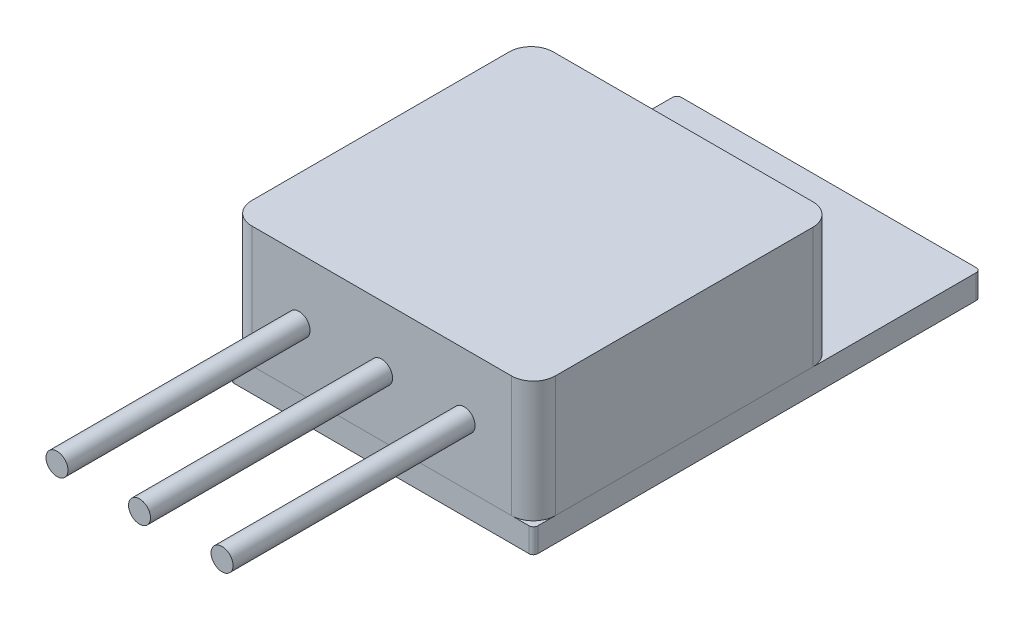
ISO-10303-21;
HEADER;
FILE_DESCRIPTION(('STEP AP214'),'2;1');
FILE_NAME('part.step','',(''),(''),'','','');
FILE_SCHEMA(('AUTOMOTIVE_DESIGN { 1 0 10303 214 1 1 1 1 }'));
ENDSEC;
DATA;
#1=APPLICATION_CONTEXT('core data for automotive mechanical design processes');
#2=APPLICATION_PROTOCOL_DEFINITION('international standard','automotive_design',2000,#1);
#3=PRODUCT_CONTEXT('',#1,'mechanical');
#4=PRODUCT('Part','Part','',(#3));
#5=PRODUCT_RELATED_PRODUCT_CATEGORY('part','',(#4));
#6=PRODUCT_DEFINITION_FORMATION('','',#4);
#7=PRODUCT_DEFINITION_CONTEXT('part definition',#1,'design');
#8=PRODUCT_DEFINITION('design','',#6,#7);
#9=PRODUCT_DEFINITION_SHAPE('','',#8);
#10=(LENGTH_UNIT() NAMED_UNIT(*) SI_UNIT(.MILLI.,.METRE.));
#11=(NAMED_UNIT(*) PLANE_ANGLE_UNIT() SI_UNIT($,.RADIAN.));
#12=(NAMED_UNIT(*) SI_UNIT($,.STERADIAN.) SOLID_ANGLE_UNIT());
#13=UNCERTAINTY_MEASURE_WITH_UNIT(LENGTH_MEASURE(1.E-05),#10,'distance_accuracy_value','');
#14=(GEOMETRIC_REPRESENTATION_CONTEXT(3) GLOBAL_UNCERTAINTY_ASSIGNED_CONTEXT((#13)) GLOBAL_UNIT_ASSIGNED_CONTEXT((#10,
#11,#12)) REPRESENTATION_CONTEXT('',''));
#15=CARTESIAN_POINT('',(0.,0.,0.));
#16=DIRECTION('',(0.,0.,1.));
#17=DIRECTION('',(1.,0.,0.));
#18=AXIS2_PLACEMENT_3D('',#15,#16,#17);
#19=CARTESIAN_POINT('',(0.,3.81,11.));
#20=DIRECTION('',(0.,0.,-1.));
#21=DIRECTION('',(-1.,0.,0.));
#22=AXIS2_PLACEMENT_3D('',#19,#20,#21);
#23=CYLINDRICAL_SURFACE('',#22,0.5);
#24=CARTESIAN_POINT('',(0.,3.81,11.));
#25=DIRECTION('',(0.,0.,1.));
#26=DIRECTION('',(1.,0.,0.));
#27=AXIS2_PLACEMENT_3D('',#24,#25,#26);
#28=CIRCLE('',#27,0.5);
#29=CARTESIAN_POINT('',(0.500000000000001,3.81,11.));
#30=VERTEX_POINT('',#29);
#31=EDGE_CURVE('E11',#30,#30,#28,.T.);
#32=ORIENTED_EDGE('',*,*,#31,.F.);
#33=EDGE_LOOP('',(#32));
#34=FACE_BOUND('',#33,.T.);
#35=CARTESIAN_POINT('',(0.,3.81,0.));
#36=DIRECTION('',(0.,0.,1.));
#37=DIRECTION('',(1.,0.,0.));
#38=AXIS2_PLACEMENT_3D('',#35,#36,#37);
#39=CIRCLE('',#38,0.5);
#40=CARTESIAN_POINT('',(0.500000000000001,3.81,0.));
#41=VERTEX_POINT('',#40);
#42=EDGE_CURVE('E46',#41,#41,#39,.T.);
#43=ORIENTED_EDGE('',*,*,#42,.T.);
#44=EDGE_LOOP('',(#43));
#45=FACE_BOUND('',#44,.T.);
#46=ADVANCED_FACE('F43',(#34,#45),#23,.T.);
#47=CARTESIAN_POINT('',(0.,3.81,11.));
#48=DIRECTION('',(0.,0.,1.));
#49=DIRECTION('',(1.,0.,0.));
#50=AXIS2_PLACEMENT_3D('',#47,#48,#49);
#51=PLANE('',#50);
#52=ORIENTED_EDGE('',*,*,#31,.T.);
#53=EDGE_LOOP('',(#52));
#54=FACE_BOUND('',#53,.T.);
#55=ADVANCED_FACE('F60',(#54),#51,.T.);
#56=CARTESIAN_POINT('',(0.,3.81,0.));
#57=DIRECTION('',(0.,0.,1.));
#58=DIRECTION('',(1.,0.,0.));
#59=AXIS2_PLACEMENT_3D('',#56,#57,#58);
#60=PLANE('',#59);
#61=ORIENTED_EDGE('',*,*,#42,.F.);
#62=EDGE_LOOP('',(#61));
#63=FACE_BOUND('',#62,.T.);
#64=ADVANCED_FACE('F58',(#63),#60,.F.);
#65=CLOSED_SHELL('',(#46,#55,#64));
#66=MANIFOLD_SOLID_BREP('B2',#65);
#67=CARTESIAN_POINT('',(-5.9,32.6455650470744,0.));
#68=DIRECTION('',(0.,0.,-1.));
#69=DIRECTION('',(-1.,0.,0.));
#70=AXIS2_PLACEMENT_3D('',#67,#68,#69);
#71=PLANE('',#70);
#72=CARTESIAN_POINT('',(-3.75,3.81,0.));
#73=DIRECTION('',(0.,0.,-1.));
#74=DIRECTION('',(-1.,0.,0.));
#75=AXIS2_PLACEMENT_3D('',#72,#73,#74);
#76=CIRCLE('',#75,0.5);
#77=CARTESIAN_POINT('',(-4.25,3.81,0.));
#78=VERTEX_POINT('',#77);
#79=EDGE_CURVE('E108',#78,#78,#76,.F.);
#80=ORIENTED_EDGE('',*,*,#79,.F.);
#81=EDGE_LOOP('',(#80));
#82=FACE_BOUND('',#81,.T.);
#83=DIRECTION('',(0.,-1.,0.));
#84=VECTOR('',#83,1.);
#85=CARTESIAN_POINT('',(5.9,32.6455650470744,0.));
#86=LINE('',#85,#84);
#87=CARTESIAN_POINT('',(5.9,6.6,0.));
#88=VERTEX_POINT('',#87);
#89=CARTESIAN_POINT('',(5.9,1.1,0.));
#90=VERTEX_POINT('',#89);
#91=EDGE_CURVE('E177',#88,#90,#86,.T.);
#92=ORIENTED_EDGE('',*,*,#91,.F.);
#93=DIRECTION('',(-1.,0.,0.));
#94=VECTOR('',#93,1.);
#95=CARTESIAN_POINT('',(-5.9,6.6,0.));
#96=LINE('',#95,#94);
#97=CARTESIAN_POINT('',(-5.9,6.6,0.));
#98=VERTEX_POINT('',#97);
#99=EDGE_CURVE('E134',#88,#98,#96,.T.);
#100=ORIENTED_EDGE('',*,*,#99,.T.);
#101=DIRECTION('',(0.,-1.,0.));
#102=VECTOR('',#101,1.);
#103=CARTESIAN_POINT('',(-5.9,32.6455650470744,0.));
#104=LINE('',#103,#102);
#105=CARTESIAN_POINT('',(-5.9,1.1,0.));
#106=VERTEX_POINT('',#105);
#107=EDGE_CURVE('E168',#98,#106,#104,.T.);
#108=ORIENTED_EDGE('',*,*,#107,.T.);
#109=DIRECTION('',(1.,0.,0.));
#110=VECTOR('',#109,1.);
#111=CARTESIAN_POINT('',(-5.9,1.1,0.));
#112=LINE('',#111,#110);
#113=EDGE_CURVE('E171',#106,#90,#112,.T.);
#114=ORIENTED_EDGE('',*,*,#113,.T.);
#115=EDGE_LOOP('',(#92,#100,#108,#114));
#116=FACE_BOUND('',#115,.T.);
#117=CARTESIAN_POINT('',(3.75,3.81,0.));
#118=DIRECTION('',(0.,0.,-1.));
#119=DIRECTION('',(-1.,0.,0.));
#120=AXIS2_PLACEMENT_3D('',#117,#118,#119);
#121=CIRCLE('',#120,0.5);
#122=CARTESIAN_POINT('',(3.25,3.81,0.));
#123=VERTEX_POINT('',#122);
#124=EDGE_CURVE('E41',#123,#123,#121,.F.);
#125=ORIENTED_EDGE('',*,*,#124,.F.);
#126=EDGE_LOOP('',(#125));
#127=FACE_BOUND('',#126,.T.);
#128=ADVANCED_FACE('F98',(#82,#116,#127),#71,.F.);
#129=CARTESIAN_POINT('',(-5.9,1.1,-1.));
#130=DIRECTION('',(0.,-1.,0.));
#131=DIRECTION('',(0.,0.,-1.));
#132=AXIS2_PLACEMENT_3D('',#129,#130,#131);
#133=PLANE('',#132);
#134=CARTESIAN_POINT('',(-5.9,1.1,-1.));
#135=DIRECTION('',(0.,1.,0.));
#136=DIRECTION('',(0.,0.,-1.));
#137=AXIS2_PLACEMENT_3D('',#134,#135,#136);
#138=CIRCLE('',#137,1.);
#139=CARTESIAN_POINT('',(-6.9,1.1,-1.00000000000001));
#140=VERTEX_POINT('',#139);
#141=EDGE_CURVE('E183',#140,#106,#138,.T.);
#142=ORIENTED_EDGE('',*,*,#141,.F.);
#143=DIRECTION('',(0.,0.,1.));
#144=VECTOR('',#143,1.);
#145=CARTESIAN_POINT('',(-6.9,1.1,-1.00000000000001));
#146=LINE('',#145,#144);
#147=CARTESIAN_POINT('',(-6.9,1.1,-12.7));
#148=VERTEX_POINT('',#147);
#149=EDGE_CURVE('E221',#148,#140,#146,.T.);
#150=ORIENTED_EDGE('',*,*,#149,.F.);
#151=CARTESIAN_POINT('',(-5.9,1.1,-12.7));
#152=DIRECTION('',(0.,1.,0.));
#153=DIRECTION('',(0.,0.,-1.));
#154=AXIS2_PLACEMENT_3D('',#151,#152,#153);
#155=CIRCLE('',#154,1.);
#156=CARTESIAN_POINT('',(-5.9,1.1,-13.7));
#157=VERTEX_POINT('',#156);
#158=EDGE_CURVE('E217',#157,#148,#155,.T.);
#159=ORIENTED_EDGE('',*,*,#158,.F.);
#160=DIRECTION('',(-1.,0.,0.));
#161=VECTOR('',#160,1.);
#162=CARTESIAN_POINT('',(-5.9,1.1,-13.7));
#163=LINE('',#162,#161);
#164=CARTESIAN_POINT('',(5.9,1.1,-13.7));
#165=VERTEX_POINT('',#164);
#166=EDGE_CURVE('E213',#165,#157,#163,.T.);
#167=ORIENTED_EDGE('',*,*,#166,.F.);
#168=CARTESIAN_POINT('',(5.9,1.1,-12.7));
#169=DIRECTION('',(0.,1.,0.));
#170=DIRECTION('',(0.,0.,1.));
#171=AXIS2_PLACEMENT_3D('',#168,#169,#170);
#172=CIRCLE('',#171,0.999999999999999);
#173=CARTESIAN_POINT('',(6.9,1.1,-12.7));
#174=VERTEX_POINT('',#173);
#175=EDGE_CURVE('E210',#174,#165,#172,.T.);
#176=ORIENTED_EDGE('',*,*,#175,.F.);
#177=DIRECTION('',(0.,0.,-1.));
#178=VECTOR('',#177,1.);
#179=CARTESIAN_POINT('',(6.9,1.1,-1.));
#180=LINE('',#179,#178);
#181=CARTESIAN_POINT('',(6.9,1.1,-1.));
#182=VERTEX_POINT('',#181);
#183=EDGE_CURVE('E206',#182,#174,#180,.T.);
#184=ORIENTED_EDGE('',*,*,#183,.F.);
#185=CARTESIAN_POINT('',(5.9,1.1,-1.));
#186=DIRECTION('',(0.,1.,0.));
#187=DIRECTION('',(0.,0.,1.));
#188=AXIS2_PLACEMENT_3D('',#185,#186,#187);
#189=CIRCLE('',#188,1.);
#190=EDGE_CURVE('E186',#90,#182,#189,.T.);
#191=ORIENTED_EDGE('',*,*,#190,.F.);
#192=ORIENTED_EDGE('',*,*,#113,.F.);
#193=EDGE_LOOP('',(#142,#150,#159,#167,#176,#184,#191,#192));
#194=FACE_BOUND('',#193,.T.);
#195=ADVANCED_FACE('F181',(#194),#133,.T.);
#196=CARTESIAN_POINT('',(-6.9,32.6455650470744,-1.00000000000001));
#197=DIRECTION('',(1.,0.,0.));
#198=DIRECTION('',(0.,0.,-1.));
#199=AXIS2_PLACEMENT_3D('',#196,#197,#198);
#200=PLANE('',#199);
#201=DIRECTION('',(0.,-1.,0.));
#202=VECTOR('',#201,1.);
#203=CARTESIAN_POINT('',(-6.9,32.6455650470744,-1.00000000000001));
#204=LINE('',#203,#202);
#205=CARTESIAN_POINT('',(-6.9,6.6,-1.00000000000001));
#206=VERTEX_POINT('',#205);
#207=EDGE_CURVE('E190',#206,#140,#204,.T.);
#208=ORIENTED_EDGE('',*,*,#207,.F.);
#209=DIRECTION('',(0.,0.,-1.));
#210=VECTOR('',#209,1.);
#211=CARTESIAN_POINT('',(-6.9,6.6,-1.00000000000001));
#212=LINE('',#211,#210);
#213=CARTESIAN_POINT('',(-6.9,6.6,-12.7));
#214=VERTEX_POINT('',#213);
#215=EDGE_CURVE('E176',#206,#214,#212,.T.);
#216=ORIENTED_EDGE('',*,*,#215,.T.);
#217=DIRECTION('',(0.,-1.,0.));
#218=VECTOR('',#217,1.);
#219=CARTESIAN_POINT('',(-6.9,32.6455650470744,-12.7));
#220=LINE('',#219,#218);
#221=EDGE_CURVE('E226',#214,#148,#220,.T.);
#222=ORIENTED_EDGE('',*,*,#221,.T.);
#223=ORIENTED_EDGE('',*,*,#149,.T.);
#224=EDGE_LOOP('',(#208,#216,#222,#223));
#225=FACE_BOUND('',#224,.T.);
#226=ADVANCED_FACE('F284',(#225),#200,.F.);
#227=CARTESIAN_POINT('',(-5.9,32.6455650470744,-12.7));
#228=DIRECTION('',(0.,-1.,0.));
#229=DIRECTION('',(0.,0.,-1.));
#230=AXIS2_PLACEMENT_3D('',#227,#228,#229);
#231=CYLINDRICAL_SURFACE('',#230,1.);
#232=ORIENTED_EDGE('',*,*,#221,.F.);
#233=CARTESIAN_POINT('',(-5.9,6.6,-12.7));
#234=DIRECTION('',(0.,-1.,0.));
#235=DIRECTION('',(0.,0.,-1.));
#236=AXIS2_PLACEMENT_3D('',#233,#234,#235);
#237=CIRCLE('',#236,1.);
#238=CARTESIAN_POINT('',(-5.9,6.6,-13.7));
#239=VERTEX_POINT('',#238);
#240=EDGE_CURVE('E245',#214,#239,#237,.T.);
#241=ORIENTED_EDGE('',*,*,#240,.T.);
#242=DIRECTION('',(0.,-1.,0.));
#243=VECTOR('',#242,1.);
#244=CARTESIAN_POINT('',(-5.9,32.6455650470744,-13.7));
#245=LINE('',#244,#243);
#246=EDGE_CURVE('E229',#239,#157,#245,.T.);
#247=ORIENTED_EDGE('',*,*,#246,.T.);
#248=ORIENTED_EDGE('',*,*,#158,.T.);
#249=EDGE_LOOP('',(#232,#241,#247,#248));
#250=FACE_BOUND('',#249,.T.);
#251=ADVANCED_FACE('F302',(#250),#231,.T.);
#252=CARTESIAN_POINT('',(-5.9,32.6455650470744,-13.7));
#253=DIRECTION('',(0.,0.,1.));
#254=DIRECTION('',(1.,0.,0.));
#255=AXIS2_PLACEMENT_3D('',#252,#253,#254);
#256=PLANE('',#255);
#257=ORIENTED_EDGE('',*,*,#246,.F.);
#258=DIRECTION('',(1.,0.,0.));
#259=VECTOR('',#258,1.);
#260=CARTESIAN_POINT('',(-5.9,6.6,-13.7));
#261=LINE('',#260,#259);
#262=CARTESIAN_POINT('',(5.9,6.6,-13.7));
#263=VERTEX_POINT('',#262);
#264=EDGE_CURVE('E116',#239,#263,#261,.T.);
#265=ORIENTED_EDGE('',*,*,#264,.T.);
#266=DIRECTION('',(0.,-1.,0.));
#267=VECTOR('',#266,1.);
#268=CARTESIAN_POINT('',(5.9,32.6455650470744,-13.7));
#269=LINE('',#268,#267);
#270=EDGE_CURVE('E232',#263,#165,#269,.T.);
#271=ORIENTED_EDGE('',*,*,#270,.T.);
#272=ORIENTED_EDGE('',*,*,#166,.T.);
#273=EDGE_LOOP('',(#257,#265,#271,#272));
#274=FACE_BOUND('',#273,.T.);
#275=ADVANCED_FACE('F298',(#274),#256,.F.);
#276=CARTESIAN_POINT('',(5.9,32.6455650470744,-12.7));
#277=DIRECTION('',(0.,-1.,0.));
#278=DIRECTION('',(0.,0.,-1.));
#279=AXIS2_PLACEMENT_3D('',#276,#277,#278);
#280=CYLINDRICAL_SURFACE('',#279,0.999999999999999);
#281=ORIENTED_EDGE('',*,*,#270,.F.);
#282=CARTESIAN_POINT('',(5.9,6.6,-12.7));
#283=DIRECTION('',(0.,-1.,0.));
#284=DIRECTION('',(0.,0.,-1.));
#285=AXIS2_PLACEMENT_3D('',#282,#283,#284);
#286=CIRCLE('',#285,0.999999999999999);
#287=CARTESIAN_POINT('',(6.9,6.6,-12.7));
#288=VERTEX_POINT('',#287);
#289=EDGE_CURVE('E261',#263,#288,#286,.T.);
#290=ORIENTED_EDGE('',*,*,#289,.T.);
#291=DIRECTION('',(0.,-1.,0.));
#292=VECTOR('',#291,1.);
#293=CARTESIAN_POINT('',(6.9,32.6455650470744,-12.7));
#294=LINE('',#293,#292);
#295=EDGE_CURVE('E235',#288,#174,#294,.T.);
#296=ORIENTED_EDGE('',*,*,#295,.T.);
#297=ORIENTED_EDGE('',*,*,#175,.T.);
#298=EDGE_LOOP('',(#281,#290,#296,#297));
#299=FACE_BOUND('',#298,.T.);
#300=ADVANCED_FACE('F294',(#299),#280,.T.);
#301=CARTESIAN_POINT('',(6.9,32.6455650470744,-1.));
#302=DIRECTION('',(-1.,0.,0.));
#303=DIRECTION('',(0.,0.,1.));
#304=AXIS2_PLACEMENT_3D('',#301,#302,#303);
#305=PLANE('',#304);
#306=ORIENTED_EDGE('',*,*,#295,.F.);
#307=DIRECTION('',(0.,0.,1.));
#308=VECTOR('',#307,1.);
#309=CARTESIAN_POINT('',(6.9,6.6,-1.));
#310=LINE('',#309,#308);
#311=CARTESIAN_POINT('',(6.9,6.6,-1.));
#312=VERTEX_POINT('',#311);
#313=EDGE_CURVE('E256',#288,#312,#310,.T.);
#314=ORIENTED_EDGE('',*,*,#313,.T.);
#315=DIRECTION('',(0.,-1.,0.));
#316=VECTOR('',#315,1.);
#317=CARTESIAN_POINT('',(6.9,32.6455650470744,-1.));
#318=LINE('',#317,#316);
#319=EDGE_CURVE('E238',#312,#182,#318,.T.);
#320=ORIENTED_EDGE('',*,*,#319,.T.);
#321=ORIENTED_EDGE('',*,*,#183,.T.);
#322=EDGE_LOOP('',(#306,#314,#320,#321));
#323=FACE_BOUND('',#322,.T.);
#324=ADVANCED_FACE('F290',(#323),#305,.F.);
#325=CARTESIAN_POINT('',(5.9,32.6455650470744,-1.));
#326=DIRECTION('',(0.,-1.,0.));
#327=DIRECTION('',(0.,0.,-1.));
#328=AXIS2_PLACEMENT_3D('',#325,#326,#327);
#329=CYLINDRICAL_SURFACE('',#328,1.);
#330=ORIENTED_EDGE('',*,*,#319,.F.);
#331=CARTESIAN_POINT('',(5.9,6.6,-1.));
#332=DIRECTION('',(0.,-1.,0.));
#333=DIRECTION('',(0.,0.,-1.));
#334=AXIS2_PLACEMENT_3D('',#331,#332,#333);
#335=CIRCLE('',#334,1.);
#336=EDGE_CURVE('E129',#312,#88,#335,.T.);
#337=ORIENTED_EDGE('',*,*,#336,.T.);
#338=ORIENTED_EDGE('',*,*,#91,.T.);
#339=ORIENTED_EDGE('',*,*,#190,.T.);
#340=EDGE_LOOP('',(#330,#337,#338,#339));
#341=FACE_BOUND('',#340,.T.);
#342=ADVANCED_FACE('F287',(#341),#329,.T.);
#343=CARTESIAN_POINT('',(-5.9,32.6455650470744,-1.));
#344=DIRECTION('',(0.,-1.,0.));
#345=DIRECTION('',(0.,0.,-1.));
#346=AXIS2_PLACEMENT_3D('',#343,#344,#345);
#347=CYLINDRICAL_SURFACE('',#346,1.);
#348=ORIENTED_EDGE('',*,*,#107,.F.);
#349=CARTESIAN_POINT('',(-5.9,6.6,-1.));
#350=DIRECTION('',(0.,-1.,0.));
#351=DIRECTION('',(0.,0.,-1.));
#352=AXIS2_PLACEMENT_3D('',#349,#350,#351);
#353=CIRCLE('',#352,1.);
#354=EDGE_CURVE('E138',#98,#206,#353,.T.);
#355=ORIENTED_EDGE('',*,*,#354,.T.);
#356=ORIENTED_EDGE('',*,*,#207,.T.);
#357=ORIENTED_EDGE('',*,*,#141,.T.);
#358=EDGE_LOOP('',(#348,#355,#356,#357));
#359=FACE_BOUND('',#358,.T.);
#360=ADVANCED_FACE('F100',(#359),#347,.T.);
#361=CARTESIAN_POINT('',(-6.7,6.6,-0.199999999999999));
#362=DIRECTION('',(0.,-1.,0.));
#363=DIRECTION('',(0.,0.,-1.));
#364=AXIS2_PLACEMENT_3D('',#361,#362,#363);
#365=PLANE('',#364);
#366=ORIENTED_EDGE('',*,*,#99,.F.);
#367=ORIENTED_EDGE('',*,*,#336,.F.);
#368=ORIENTED_EDGE('',*,*,#313,.F.);
#369=ORIENTED_EDGE('',*,*,#289,.F.);
#370=ORIENTED_EDGE('',*,*,#264,.F.);
#371=ORIENTED_EDGE('',*,*,#240,.F.);
#372=ORIENTED_EDGE('',*,*,#215,.F.);
#373=ORIENTED_EDGE('',*,*,#354,.F.);
#374=EDGE_LOOP('',(#366,#367,#368,#369,#370,#371,#372,#373));
#375=FACE_BOUND('',#374,.T.);
#376=ADVANCED_FACE('F310',(#375),#365,.F.);
#377=CARTESIAN_POINT('',(-3.75,3.81,11.));
#378=DIRECTION('',(0.,0.,-1.));
#379=DIRECTION('',(-1.,0.,0.));
#380=AXIS2_PLACEMENT_3D('',#377,#378,#379);
#381=CYLINDRICAL_SURFACE('',#380,0.5);
#382=CARTESIAN_POINT('',(-3.75,3.81,11.));
#383=DIRECTION('',(0.,0.,1.));
#384=DIRECTION('',(1.,0.,0.));
#385=AXIS2_PLACEMENT_3D('',#382,#383,#384);
#386=CIRCLE('',#385,0.5);
#387=CARTESIAN_POINT('',(-3.25,3.81,11.));
#388=VERTEX_POINT('',#387);
#389=EDGE_CURVE('E193',#388,#388,#386,.T.);
#390=ORIENTED_EDGE('',*,*,#389,.F.);
#391=EDGE_LOOP('',(#390));
#392=FACE_BOUND('',#391,.T.);
#393=ORIENTED_EDGE('',*,*,#79,.T.);
#394=EDGE_LOOP('',(#393));
#395=FACE_BOUND('',#394,.T.);
#396=ADVANCED_FACE('F313',(#392,#395),#381,.T.);
#397=CARTESIAN_POINT('',(-3.75,3.81,11.));
#398=DIRECTION('',(0.,0.,1.));
#399=DIRECTION('',(1.,0.,0.));
#400=AXIS2_PLACEMENT_3D('',#397,#398,#399);
#401=PLANE('',#400);
#402=ORIENTED_EDGE('',*,*,#389,.T.);
#403=EDGE_LOOP('',(#402));
#404=FACE_BOUND('',#403,.T.);
#405=ADVANCED_FACE('F276',(#404),#401,.T.);
#406=CARTESIAN_POINT('',(3.75,3.81,11.));
#407=DIRECTION('',(0.,0.,-1.));
#408=DIRECTION('',(-1.,0.,0.));
#409=AXIS2_PLACEMENT_3D('',#406,#407,#408);
#410=CYLINDRICAL_SURFACE('',#409,0.5);
#411=CARTESIAN_POINT('',(3.75,3.81,11.));
#412=DIRECTION('',(0.,0.,1.));
#413=DIRECTION('',(1.,0.,0.));
#414=AXIS2_PLACEMENT_3D('',#411,#412,#413);
#415=CIRCLE('',#414,0.5);
#416=CARTESIAN_POINT('',(4.25,3.81,11.));
#417=VERTEX_POINT('',#416);
#418=EDGE_CURVE('E199',#417,#417,#415,.T.);
#419=ORIENTED_EDGE('',*,*,#418,.F.);
#420=EDGE_LOOP('',(#419));
#421=FACE_BOUND('',#420,.T.);
#422=ORIENTED_EDGE('',*,*,#124,.T.);
#423=EDGE_LOOP('',(#422));
#424=FACE_BOUND('',#423,.T.);
#425=ADVANCED_FACE('F273',(#421,#424),#410,.T.);
#426=CARTESIAN_POINT('',(3.75,3.81,11.));
#427=DIRECTION('',(0.,0.,1.));
#428=DIRECTION('',(1.,0.,0.));
#429=AXIS2_PLACEMENT_3D('',#426,#427,#428);
#430=PLANE('',#429);
#431=ORIENTED_EDGE('',*,*,#418,.T.);
#432=EDGE_LOOP('',(#431));
#433=FACE_BOUND('',#432,.T.);
#434=ADVANCED_FACE('F271',(#433),#430,.T.);
#435=CLOSED_SHELL('',(#128,#195,#226,#251,#275,#300,#324,#342,#360,#376,#396,#405,#425,#434));
#436=MANIFOLD_SOLID_BREP('B6',#435);
#437=CARTESIAN_POINT('',(-6.7,1.1,-0.199999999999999));
#438=DIRECTION('',(0.,-1.,0.));
#439=DIRECTION('',(0.,0.,-1.));
#440=AXIS2_PLACEMENT_3D('',#437,#438,#439);
#441=PLANE('',#440);
#442=CARTESIAN_POINT('',(-6.7,1.1,-0.199999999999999));
#443=DIRECTION('',(0.,1.,0.));
#444=DIRECTION('',(0.,0.,-1.));
#445=AXIS2_PLACEMENT_3D('',#442,#443,#444);
#446=CIRCLE('',#445,0.2);
#447=CARTESIAN_POINT('',(-6.9,1.1,-0.199999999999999));
#448=VERTEX_POINT('',#447);
#449=CARTESIAN_POINT('',(-6.7,1.1,0.));
#450=VERTEX_POINT('',#449);
#451=EDGE_CURVE('E554',#448,#450,#446,.T.);
#452=ORIENTED_EDGE('',*,*,#451,.T.);
#453=DIRECTION('',(1.,0.,0.));
#454=VECTOR('',#453,1.);
#455=CARTESIAN_POINT('',(6.7,1.1,0.));
#456=LINE('',#455,#454);
#457=CARTESIAN_POINT('',(6.7,1.1,0.));
#458=VERTEX_POINT('',#457);
#459=EDGE_CURVE('E489',#450,#458,#456,.T.);
#460=ORIENTED_EDGE('',*,*,#459,.T.);
#461=CARTESIAN_POINT('',(6.7,1.1,-0.199999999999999));
#462=DIRECTION('',(0.,1.,0.));
#463=DIRECTION('',(0.,0.,-1.));
#464=AXIS2_PLACEMENT_3D('',#461,#462,#463);
#465=CIRCLE('',#464,0.2);
#466=CARTESIAN_POINT('',(6.9,1.1,-0.199999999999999));
#467=VERTEX_POINT('',#466);
#468=EDGE_CURVE('E575',#458,#467,#465,.T.);
#469=ORIENTED_EDGE('',*,*,#468,.T.);
#470=DIRECTION('',(0.,0.,-1.));
#471=VECTOR('',#470,1.);
#472=CARTESIAN_POINT('',(6.9,1.1,-0.199999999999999));
#473=LINE('',#472,#471);
#474=CARTESIAN_POINT('',(6.9,1.1,-20.12));
#475=VERTEX_POINT('',#474);
#476=EDGE_CURVE('E588',#467,#475,#473,.T.);
#477=ORIENTED_EDGE('',*,*,#476,.T.);
#478=CARTESIAN_POINT('',(6.7,1.1,-20.12));
#479=DIRECTION('',(0.,1.,0.));
#480=DIRECTION('',(0.,0.,1.));
#481=AXIS2_PLACEMENT_3D('',#478,#479,#480);
#482=CIRCLE('',#481,0.2);
#483=CARTESIAN_POINT('',(6.7,1.1,-20.32));
#484=VERTEX_POINT('',#483);
#485=EDGE_CURVE('E508',#475,#484,#482,.T.);
#486=ORIENTED_EDGE('',*,*,#485,.T.);
#487=DIRECTION('',(-1.,0.,0.));
#488=VECTOR('',#487,1.);
#489=CARTESIAN_POINT('',(6.7,1.1,-20.32));
#490=LINE('',#489,#488);
#491=CARTESIAN_POINT('',(-6.7,1.1,-20.32));
#492=VERTEX_POINT('',#491);
#493=EDGE_CURVE('E502',#484,#492,#490,.T.);
#494=ORIENTED_EDGE('',*,*,#493,.T.);
#495=CARTESIAN_POINT('',(-6.7,1.1,-20.12));
#496=DIRECTION('',(0.,1.,0.));
#497=DIRECTION('',(0.,0.,-1.));
#498=AXIS2_PLACEMENT_3D('',#495,#496,#497);
#499=CIRCLE('',#498,0.2);
#500=CARTESIAN_POINT('',(-6.9,1.1,-20.12));
#501=VERTEX_POINT('',#500);
#502=EDGE_CURVE('E506',#492,#501,#499,.T.);
#503=ORIENTED_EDGE('',*,*,#502,.T.);
#504=DIRECTION('',(0.,0.,1.));
#505=VECTOR('',#504,1.);
#506=CARTESIAN_POINT('',(-6.9,1.1,-0.199999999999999));
#507=LINE('',#506,#505);
#508=EDGE_CURVE('E446',#501,#448,#507,.T.);
#509=ORIENTED_EDGE('',*,*,#508,.T.);
#510=EDGE_LOOP('',(#452,#460,#469,#477,#486,#494,#503,#509));
#511=FACE_BOUND('',#510,.T.);
#512=CARTESIAN_POINT('',(0.,1.1,-17.2));
#513=DIRECTION('',(0.,1.,0.));
#514=DIRECTION('',(0.,0.,1.));
#515=AXIS2_PLACEMENT_3D('',#512,#513,#514);
#516=CIRCLE('',#515,1.825);
#517=CARTESIAN_POINT('',(0.,1.1,-15.375));
#518=VERTEX_POINT('',#517);
#519=EDGE_CURVE('E601',#518,#518,#516,.T.);
#520=ORIENTED_EDGE('',*,*,#519,.F.);
#521=EDGE_LOOP('',(#520));
#522=FACE_BOUND('',#521,.T.);
#523=ADVANCED_FACE('F428',(#511,#522),#441,.F.);
#524=CARTESIAN_POINT('',(-6.7,1.1,-0.199999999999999));
#525=DIRECTION('',(0.,-1.,0.));
#526=DIRECTION('',(0.,0.,-1.));
#527=AXIS2_PLACEMENT_3D('',#524,#525,#526);
#528=CYLINDRICAL_SURFACE('',#527,0.2);
#529=CARTESIAN_POINT('',(-6.7,0.,-0.199999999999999));
#530=DIRECTION('',(0.,1.,0.));
#531=DIRECTION('',(0.,0.,-1.));
#532=AXIS2_PLACEMENT_3D('',#529,#530,#531);
#533=CIRCLE('',#532,0.2);
#534=CARTESIAN_POINT('',(-6.9,0.,-0.199999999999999));
#535=VERTEX_POINT('',#534);
#536=CARTESIAN_POINT('',(-6.7,0.,0.));
#537=VERTEX_POINT('',#536);
#538=EDGE_CURVE('E531',#535,#537,#533,.T.);
#539=ORIENTED_EDGE('',*,*,#538,.T.);
#540=DIRECTION('',(0.,-1.,0.));
#541=VECTOR('',#540,1.);
#542=CARTESIAN_POINT('',(-6.7,1.1,0.));
#543=LINE('',#542,#541);
#544=EDGE_CURVE('E96',#450,#537,#543,.T.);
#545=ORIENTED_EDGE('',*,*,#544,.F.);
#546=ORIENTED_EDGE('',*,*,#451,.F.);
#547=DIRECTION('',(0.,-1.,0.));
#548=VECTOR('',#547,1.);
#549=CARTESIAN_POINT('',(-6.9,1.1,-0.199999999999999));
#550=LINE('',#549,#548);
#551=EDGE_CURVE('E527',#448,#535,#550,.T.);
#552=ORIENTED_EDGE('',*,*,#551,.T.);
#553=EDGE_LOOP('',(#539,#545,#546,#552));
#554=FACE_BOUND('',#553,.T.);
#555=ADVANCED_FACE('F430',(#554),#528,.T.);
#556=CARTESIAN_POINT('',(6.7,1.1,0.));
#557=DIRECTION('',(0.,0.,-1.));
#558=DIRECTION('',(-1.,0.,0.));
#559=AXIS2_PLACEMENT_3D('',#556,#557,#558);
#560=PLANE('',#559);
#561=DIRECTION('',(1.,0.,0.));
#562=VECTOR('',#561,1.);
#563=CARTESIAN_POINT('',(6.7,0.,0.));
#564=LINE('',#563,#562);
#565=CARTESIAN_POINT('',(6.7,0.,0.));
#566=VERTEX_POINT('',#565);
#567=EDGE_CURVE('E535',#537,#566,#564,.T.);
#568=ORIENTED_EDGE('',*,*,#567,.T.);
#569=DIRECTION('',(0.,-1.,0.));
#570=VECTOR('',#569,1.);
#571=CARTESIAN_POINT('',(6.7,1.1,0.));
#572=LINE('',#571,#570);
#573=EDGE_CURVE('E438',#458,#566,#572,.T.);
#574=ORIENTED_EDGE('',*,*,#573,.F.);
#575=ORIENTED_EDGE('',*,*,#459,.F.);
#576=ORIENTED_EDGE('',*,*,#544,.T.);
#577=EDGE_LOOP('',(#568,#574,#575,#576));
#578=FACE_BOUND('',#577,.T.);
#579=ADVANCED_FACE('F612',(#578),#560,.F.);
#580=CARTESIAN_POINT('',(6.7,1.1,-0.199999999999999));
#581=DIRECTION('',(0.,-1.,0.));
#582=DIRECTION('',(0.,0.,-1.));
#583=AXIS2_PLACEMENT_3D('',#580,#581,#582);
#584=CYLINDRICAL_SURFACE('',#583,0.2);
#585=CARTESIAN_POINT('',(6.7,0.,-0.199999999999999));
#586=DIRECTION('',(0.,1.,0.));
#587=DIRECTION('',(0.,0.,-1.));
#588=AXIS2_PLACEMENT_3D('',#585,#586,#587);
#589=CIRCLE('',#588,0.2);
#590=CARTESIAN_POINT('',(6.9,0.,-0.199999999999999));
#591=VERTEX_POINT('',#590);
#592=EDGE_CURVE('E539',#566,#591,#589,.T.);
#593=ORIENTED_EDGE('',*,*,#592,.T.);
#594=DIRECTION('',(0.,-1.,0.));
#595=VECTOR('',#594,1.);
#596=CARTESIAN_POINT('',(6.9,1.1,-0.199999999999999));
#597=LINE('',#596,#595);
#598=EDGE_CURVE('E565',#467,#591,#597,.T.);
#599=ORIENTED_EDGE('',*,*,#598,.F.);
#600=ORIENTED_EDGE('',*,*,#468,.F.);
#601=ORIENTED_EDGE('',*,*,#573,.T.);
#602=EDGE_LOOP('',(#593,#599,#600,#601));
#603=FACE_BOUND('',#602,.T.);
#604=ADVANCED_FACE('F573',(#603),#584,.T.);
#605=CARTESIAN_POINT('',(6.9,1.1,-0.199999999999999));
#606=DIRECTION('',(-1.,0.,0.));
#607=DIRECTION('',(0.,0.,1.));
#608=AXIS2_PLACEMENT_3D('',#605,#606,#607);
#609=PLANE('',#608);
#610=DIRECTION('',(0.,0.,-1.));
#611=VECTOR('',#610,1.);
#612=CARTESIAN_POINT('',(6.9,0.,-0.199999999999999));
#613=LINE('',#612,#611);
#614=CARTESIAN_POINT('',(6.9,0.,-20.12));
#615=VERTEX_POINT('',#614);
#616=EDGE_CURVE('E542',#591,#615,#613,.T.);
#617=ORIENTED_EDGE('',*,*,#616,.T.);
#618=DIRECTION('',(0.,-1.,0.));
#619=VECTOR('',#618,1.);
#620=CARTESIAN_POINT('',(6.9,1.1,-20.12));
#621=LINE('',#620,#619);
#622=EDGE_CURVE('E561',#475,#615,#621,.T.);
#623=ORIENTED_EDGE('',*,*,#622,.F.);
#624=ORIENTED_EDGE('',*,*,#476,.F.);
#625=ORIENTED_EDGE('',*,*,#598,.T.);
#626=EDGE_LOOP('',(#617,#623,#624,#625));
#627=FACE_BOUND('',#626,.T.);
#628=ADVANCED_FACE('F583',(#627),#609,.F.);
#629=CARTESIAN_POINT('',(6.7,1.1,-20.12));
#630=DIRECTION('',(0.,-1.,0.));
#631=DIRECTION('',(0.,0.,-1.));
#632=AXIS2_PLACEMENT_3D('',#629,#630,#631);
#633=CYLINDRICAL_SURFACE('',#632,0.2);
#634=CARTESIAN_POINT('',(6.7,0.,-20.12));
#635=DIRECTION('',(0.,1.,0.));
#636=DIRECTION('',(0.,0.,1.));
#637=AXIS2_PLACEMENT_3D('',#634,#635,#636);
#638=CIRCLE('',#637,0.2);
#639=CARTESIAN_POINT('',(6.7,0.,-20.32));
#640=VERTEX_POINT('',#639);
#641=EDGE_CURVE('E545',#615,#640,#638,.T.);
#642=ORIENTED_EDGE('',*,*,#641,.T.);
#643=DIRECTION('',(0.,-1.,0.));
#644=VECTOR('',#643,1.);
#645=CARTESIAN_POINT('',(6.7,1.1,-20.32));
#646=LINE('',#645,#644);
#647=EDGE_CURVE('E519',#484,#640,#646,.T.);
#648=ORIENTED_EDGE('',*,*,#647,.F.);
#649=ORIENTED_EDGE('',*,*,#485,.F.);
#650=ORIENTED_EDGE('',*,*,#622,.T.);
#651=EDGE_LOOP('',(#642,#648,#649,#650));
#652=FACE_BOUND('',#651,.T.);
#653=ADVANCED_FACE('F586',(#652),#633,.T.);
#654=CARTESIAN_POINT('',(6.7,1.1,-20.32));
#655=DIRECTION('',(0.,0.,1.));
#656=DIRECTION('',(1.,0.,0.));
#657=AXIS2_PLACEMENT_3D('',#654,#655,#656);
#658=PLANE('',#657);
#659=DIRECTION('',(-1.,0.,0.));
#660=VECTOR('',#659,1.);
#661=CARTESIAN_POINT('',(6.7,0.,-20.32));
#662=LINE('',#661,#660);
#663=CARTESIAN_POINT('',(-6.7,0.,-20.32));
#664=VERTEX_POINT('',#663);
#665=EDGE_CURVE('E517',#640,#664,#662,.T.);
#666=ORIENTED_EDGE('',*,*,#665,.T.);
#667=DIRECTION('',(0.,-1.,0.));
#668=VECTOR('',#667,1.);
#669=CARTESIAN_POINT('',(-6.7,1.1,-20.32));
#670=LINE('',#669,#668);
#671=EDGE_CURVE('E514',#492,#664,#670,.T.);
#672=ORIENTED_EDGE('',*,*,#671,.F.);
#673=ORIENTED_EDGE('',*,*,#493,.F.);
#674=ORIENTED_EDGE('',*,*,#647,.T.);
#675=EDGE_LOOP('',(#666,#672,#673,#674));
#676=FACE_BOUND('',#675,.T.);
#677=ADVANCED_FACE('F515',(#676),#658,.F.);
#678=CARTESIAN_POINT('',(-6.7,1.1,-20.12));
#679=DIRECTION('',(0.,-1.,0.));
#680=DIRECTION('',(0.,0.,-1.));
#681=AXIS2_PLACEMENT_3D('',#678,#679,#680);
#682=CYLINDRICAL_SURFACE('',#681,0.2);
#683=CARTESIAN_POINT('',(-6.7,0.,-20.12));
#684=DIRECTION('',(0.,1.,0.));
#685=DIRECTION('',(0.,0.,-1.));
#686=AXIS2_PLACEMENT_3D('',#683,#684,#685);
#687=CIRCLE('',#686,0.2);
#688=CARTESIAN_POINT('',(-6.9,0.,-20.12));
#689=VERTEX_POINT('',#688);
#690=EDGE_CURVE('E475',#664,#689,#687,.T.);
#691=ORIENTED_EDGE('',*,*,#690,.T.);
#692=DIRECTION('',(0.,-1.,0.));
#693=VECTOR('',#692,1.);
#694=CARTESIAN_POINT('',(-6.9,1.1,-20.12));
#695=LINE('',#694,#693);
#696=EDGE_CURVE('E520',#501,#689,#695,.T.);
#697=ORIENTED_EDGE('',*,*,#696,.F.);
#698=ORIENTED_EDGE('',*,*,#502,.F.);
#699=ORIENTED_EDGE('',*,*,#671,.T.);
#700=EDGE_LOOP('',(#691,#697,#698,#699));
#701=FACE_BOUND('',#700,.T.);
#702=ADVANCED_FACE('F522',(#701),#682,.T.);
#703=CARTESIAN_POINT('',(-6.9,1.1,-0.199999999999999));
#704=DIRECTION('',(1.,0.,0.));
#705=DIRECTION('',(0.,0.,-1.));
#706=AXIS2_PLACEMENT_3D('',#703,#704,#705);
#707=PLANE('',#706);
#708=DIRECTION('',(0.,0.,1.));
#709=VECTOR('',#708,1.);
#710=CARTESIAN_POINT('',(-6.9,0.,-0.199999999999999));
#711=LINE('',#710,#709);
#712=EDGE_CURVE('E481',#689,#535,#711,.T.);
#713=ORIENTED_EDGE('',*,*,#712,.T.);
#714=ORIENTED_EDGE('',*,*,#551,.F.);
#715=ORIENTED_EDGE('',*,*,#508,.F.);
#716=ORIENTED_EDGE('',*,*,#696,.T.);
#717=EDGE_LOOP('',(#713,#714,#715,#716));
#718=FACE_BOUND('',#717,.T.);
#719=ADVANCED_FACE('F618',(#718),#707,.F.);
#720=CARTESIAN_POINT('',(-6.7,0.,-0.199999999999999));
#721=DIRECTION('',(0.,-1.,0.));
#722=DIRECTION('',(0.,0.,-1.));
#723=AXIS2_PLACEMENT_3D('',#720,#721,#722);
#724=PLANE('',#723);
#725=CARTESIAN_POINT('',(0.,0.,-17.2));
#726=DIRECTION('',(0.,-1.,0.));
#727=DIRECTION('',(0.,0.,-1.));
#728=AXIS2_PLACEMENT_3D('',#725,#726,#727);
#729=CIRCLE('',#728,1.825);
#730=CARTESIAN_POINT('',(0.,0.,-19.025));
#731=VERTEX_POINT('',#730);
#732=EDGE_CURVE('E536',#731,#731,#729,.T.);
#733=ORIENTED_EDGE('',*,*,#732,.F.);
#734=EDGE_LOOP('',(#733));
#735=FACE_BOUND('',#734,.T.);
#736=ORIENTED_EDGE('',*,*,#538,.F.);
#737=ORIENTED_EDGE('',*,*,#712,.F.);
#738=ORIENTED_EDGE('',*,*,#690,.F.);
#739=ORIENTED_EDGE('',*,*,#665,.F.);
#740=ORIENTED_EDGE('',*,*,#641,.F.);
#741=ORIENTED_EDGE('',*,*,#616,.F.);
#742=ORIENTED_EDGE('',*,*,#592,.F.);
#743=ORIENTED_EDGE('',*,*,#567,.F.);
#744=EDGE_LOOP('',(#736,#737,#738,#739,#740,#741,#742,#743));
#745=FACE_BOUND('',#744,.T.);
#746=ADVANCED_FACE('F579',(#735,#745),#724,.T.);
#747=CARTESIAN_POINT('',(0.,1.1,-17.2));
#748=DIRECTION('',(0.,1.,0.));
#749=DIRECTION('',(0.,0.,1.));
#750=AXIS2_PLACEMENT_3D('',#747,#748,#749);
#751=CYLINDRICAL_SURFACE('',#750,1.825);
#752=ORIENTED_EDGE('',*,*,#519,.T.);
#753=EDGE_LOOP('',(#752));
#754=FACE_BOUND('',#753,.T.);
#755=ORIENTED_EDGE('',*,*,#732,.T.);
#756=EDGE_LOOP('',(#755));
#757=FACE_BOUND('',#756,.T.);
#758=ADVANCED_FACE('F605',(#754,#757),#751,.F.);
#759=CLOSED_SHELL('',(#523,#555,#579,#604,#628,#653,#677,#702,#719,#746,#758));
#760=MANIFOLD_SOLID_BREP('B35',#759);
#761=ADVANCED_BREP_SHAPE_REPRESENTATION('',(#18,#66,#436,#760),#14);
#762=SHAPE_DEFINITION_REPRESENTATION(#9,#761);
ENDSEC;
END-ISO-10303-21;
